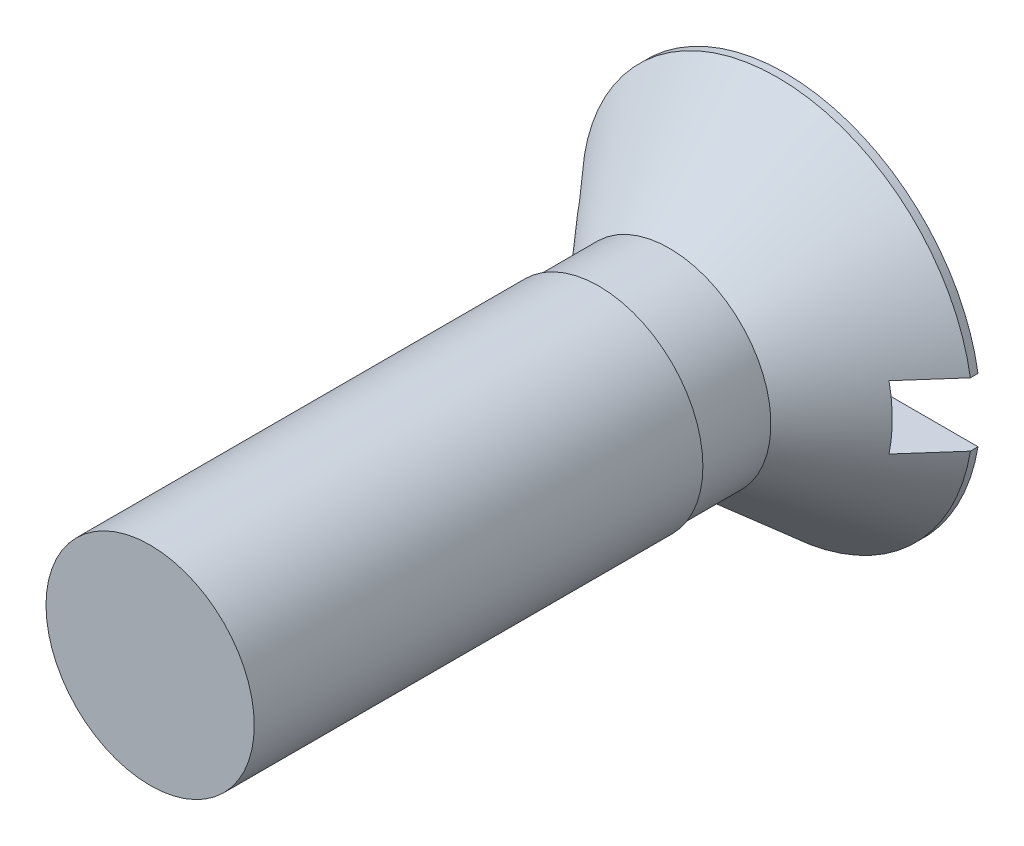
from build123d import *

# Parameters (mm, degrees)
SKETCH_2_W          = 1.016
SKETCH_2_H          = 1.27
CUT_EXTRUDE_1_DEPTH = 5.08


with BuildPart() as part:
    # Sketch 1 → Revolve 1 (revolve)
    with BuildSketch(Plane(origin=(0, 0, 0), x_dir=(0, 0, -1), z_dir=(1, 0, 0)), mode=Mode.PRIVATE) as revolve_1_sk:
        Polygon((0, 0), (0, 3.9116), (-0.1524, 3.9116), (-2.314632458, 2.032), (-3.725743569, 2.032), (-3.725743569, 2.0828), (-12.7, 2.0828), (-12.7, 0), align=None)
    revolve(revolve_1_sk.sketch.rotate(Axis((0, 0, 0), (0, 0, 1)), 90), axis=Axis((0, 0, 0), (0, 0, 1)))

    # Sketch 2 → Cut-Extrude 1 (cut, symmetric)
    with BuildSketch(Plane(origin=(0, 0, 0), x_dir=(0, 0, -1), z_dir=(1, 0, 0))):
        with Locations((-0.508, 0)):
            Rectangle(SKETCH_2_W, SKETCH_2_H)
    extrude(amount=CUT_EXTRUDE_1_DEPTH, both=True, mode=Mode.SUBTRACT)


solid = part.part
